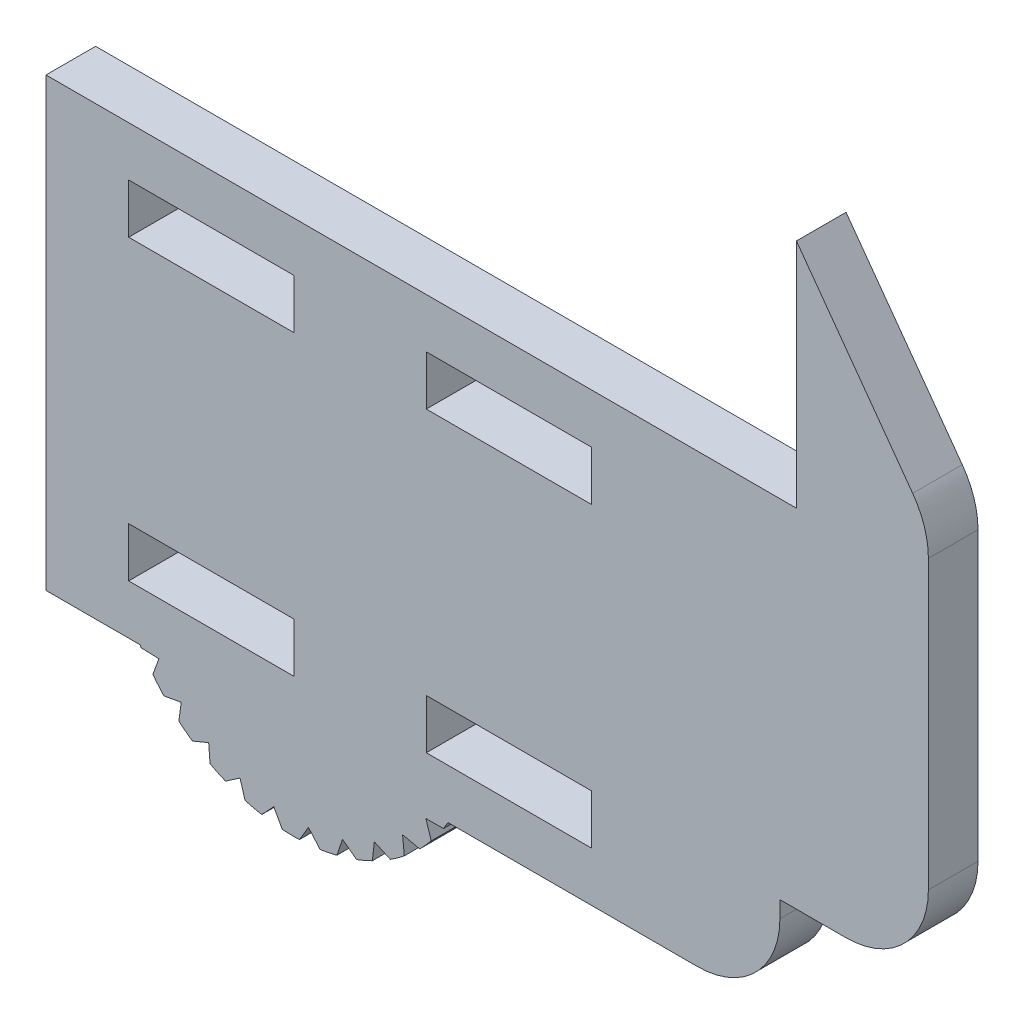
from build123d import *

# Parameters (mm, degrees)
BOSS_EXTRU_1_DEPTH           = 3
ESQUISSE2_W                  = 10
ESQUISSE2_H                  = 3
ENL_V_MAT_EXTRU_1_DEPTH      = 3
CONG_1_R                     = 5
CONG_2_R                     = 5
BOSS_EXTRU_2_DEPTH           = 3
CONG_3_R                     = 5
ENL_V_START                  = -10
ENL_V_MAT_EXTRU_2_DEPTH      = 10
R_P_TITION_CIRCULAIRE1_COUNT = 10
R_P_TITION_CIRCULAIRE1_ANGLE = 110


with BuildPart() as part:
    # Esquisse1 → Boss.-Extru.1 (new body)
    with BuildSketch(Plane.XY):
        Polygon((0, 35), (7.981262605, 23.983369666), (7.981262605, 0), (-1, 0), (-1, -6), (-45.384651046, -6), (-45.384651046, 21), (0, 21), align=None)
    extrude(amount=BOSS_EXTRU_1_DEPTH)

    # Esquisse2 → Enl_v. mat.-Extru.1 (cut)
    with BuildSketch(Plane(origin=(0, 0, 0), x_dir=(-1, 0, 0), z_dir=(0, 0, -1))):
        with Locations((17.384651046, 16.5)):
            Rectangle(ESQUISSE2_W, ESQUISSE2_H)
        with Locations((35.384651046, 16.5)):
            Rectangle(ESQUISSE2_W, ESQUISSE2_H)
        with Locations((17.384651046, -1.5)):
            Rectangle(ESQUISSE2_W, ESQUISSE2_H)
        with Locations((35.384651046, -1.5)):
            Rectangle(ESQUISSE2_W, ESQUISSE2_H)
    extrude(amount=-ENL_V_MAT_EXTRU_1_DEPTH, mode=Mode.SUBTRACT)

    # Cong_1
    cong_1_edges = [part.edges().sort_by_distance(p)[0] for p in [
        (7.981262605, 23.983369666, 1.5),
    ]]
    fillet(cong_1_edges, radius=CONG_1_R)

    # Cong_2
    cong_2_edges = [part.edges().sort_by_distance(p)[0] for p in [
        (7.981262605, 0, 1.5),
    ]]
    fillet(cong_2_edges, radius=CONG_2_R)

    # Esquisse3 → Boss.-Extru.2 (add)
    with BuildSketch(Plane.XY.offset(3)):
        with BuildLine():
            Line((-21.074206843, -6), (-39.69509525, -6))
            ThreePointArc((-39.69509525, -6), (-30.384651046, -11.391612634), (-21.074206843, -6))
        make_face()
    extrude(amount=-BOSS_EXTRU_2_DEPTH)

    # Cong_3
    cong_3_edges = [part.edges().sort_by_distance(p)[0] for p in [
        (-1, -6, 1.5),
    ]]
    fillet(cong_3_edges, radius=CONG_3_R)

    # Esquisse4 → Enl_v. mat.-Extru.2 (cut)
    with BuildSketch(Plane(origin=(0, 0, 0), x_dir=(-1, 0, 0), z_dir=(0, 0, -1)).offset(ENL_V_START)):
        with BuildLine():
            Line((21.349553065, -6.453465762), (22.413568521, -6.453465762))
            Line((22.413568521, -6.453465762), (22.085624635, -7.465681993))
            ThreePointArc((22.085624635, -7.465681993), (21.702824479, -6.970310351), (21.349553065, -6.453465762))
        make_face()
    enl_v_mat_extru_2 = extrude(amount=ENL_V_MAT_EXTRU_2_DEPTH, mode=Mode.SUBTRACT)

    # R_p_tition circulaire1: Enl_v. mat.-Extru.2 ×10 about axis
    r_p_tition_circulaire1_axis = Axis((-30.384651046, -0.656989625, 0), (0, 0, -1))
    for i in range(1, R_P_TITION_CIRCULAIRE1_COUNT):
        add(enl_v_mat_extru_2.rotate(r_p_tition_circulaire1_axis, i * R_P_TITION_CIRCULAIRE1_ANGLE / (R_P_TITION_CIRCULAIRE1_COUNT - 1)), mode=Mode.SUBTRACT)


solid = part.part
